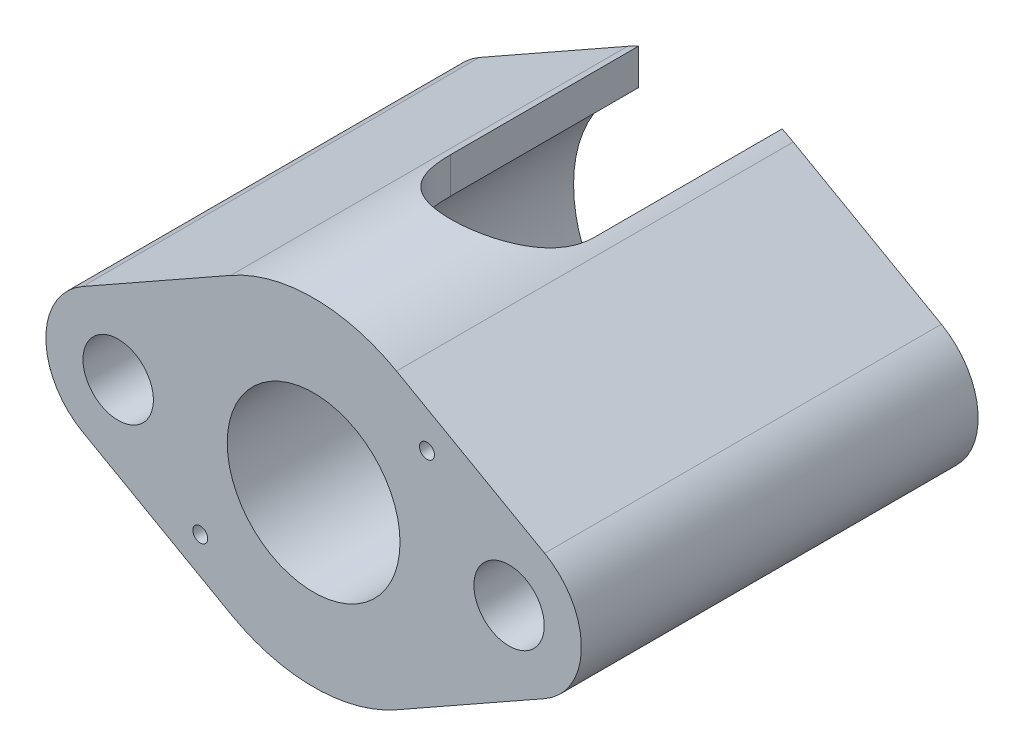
from build123d import *

# Parameters (mm, degrees)
SKETCH1_R               = 2.286
SKETCH1_R_2             = 5.6134
BOSS_EXTRUDE1_DEPTH     = 25.781
SKETCH2_R               = 8.89
CUT_EXTRUDE1_DEPTH      = 17.2466
CUT_EXTRUDE2_DEPTH      = 33.973181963
CUT_EXTRUDE2_DEPTH_BACK = 33.973181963
SKETCH8_R               = 0.4826
CUT_EXTRUDE5_DEPTH      = 6.35


with BuildPart() as part:
    # Sketch1 → Boss-Extrude1 (new body)
    with BuildSketch(Plane.XY):
        with BuildLine():
            Line((5.3861208, 9.530753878), (15.011908, 4.090926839))
            ThreePointArc((15.011908, 4.090926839), (17.399, 0), (15.011908, -4.090926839))
            Line((15.011908, -4.090926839), (5.3861208, -9.530753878))
            ThreePointArc((5.3861208, -9.530753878), (0, -10.9474), (-5.3861208, -9.530753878))
            Line((-5.3861208, -9.530753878), (-15.011908, -4.090926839))
            ThreePointArc((-15.011908, -4.090926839), (-17.399, 0), (-15.011908, 4.090926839))
            Line((-15.011908, 4.090926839), (-5.3861208, 9.530753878))
            ThreePointArc((-5.3861208, 9.530753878), (0, 10.9474), (5.3861208, 9.530753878))
        make_face()
        with Locations((12.7, 0)):
            Circle(SKETCH1_R, mode=Mode.SUBTRACT)
        Circle(SKETCH1_R_2, mode=Mode.SUBTRACT)
        with Locations(Location((-12.7, 0, 0), (0, 0, 180))):
            Circle(SKETCH1_R, mode=Mode.SUBTRACT)
    extrude(amount=BOSS_EXTRUDE1_DEPTH)

    # Sketch2 → Cut-Extrude1 (cut)
    with BuildSketch(Plane(origin=(0, 0, 0), x_dir=(-1, 0, 0), z_dir=(0, 0, -1))):
        Circle(SKETCH2_R)
    extrude(amount=-CUT_EXTRUDE1_DEPTH, mode=Mode.SUBTRACT)

    # Sketch3 → Cut-Extrude2 (cut, two sides: drawn at the far end of the back side and taken through both)
    with BuildSketch(Plane(origin=(0, 0, 0), x_dir=(1, 0, 0), z_dir=(0, 1, 0)).offset(-CUT_EXTRUDE2_DEPTH_BACK)):
        with BuildLine():
            Line((0, 0), (4.6609, 0))
            Line((4.6609, 0), (4.6609, -12.2301))
            ThreePointArc((4.6609, -12.2301), (0, -16.891), (-4.6609, -12.2301))
            Line((-4.6609, -12.2301), (-4.6609, 0))
            Line((-4.6609, 0), (0, 0))
        make_face()
    extrude(amount=CUT_EXTRUDE2_DEPTH + CUT_EXTRUDE2_DEPTH_BACK, mode=Mode.SUBTRACT)

    # Sketch8 → Cut-Extrude5 (cut)
    with BuildSketch(Plane.XY.offset(25.781)):
        with Locations((7.366, 6.038846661)):
            Circle(SKETCH8_R)
        with Locations((-7.366, -6.038846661)):
            Circle(SKETCH8_R)
    extrude(amount=-CUT_EXTRUDE5_DEPTH, mode=Mode.SUBTRACT)


solid = part.part
